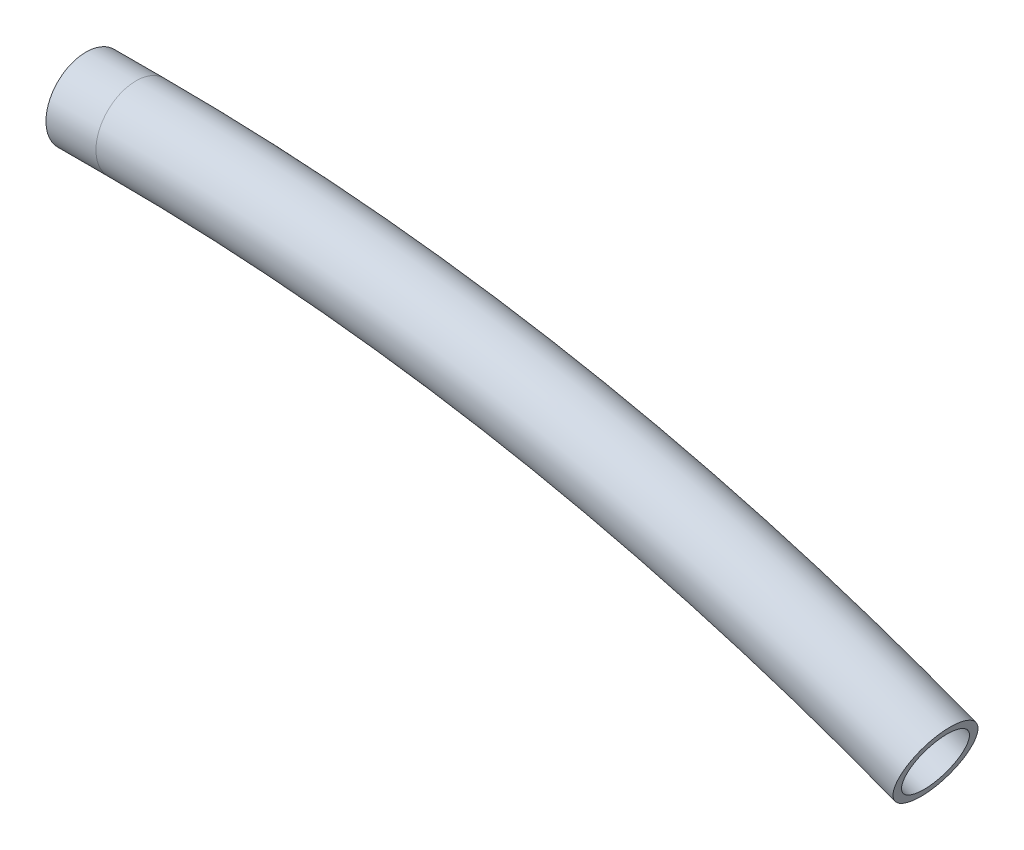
ISO-10303-21;
HEADER;
FILE_DESCRIPTION(('STEP AP214'),'2;1');
FILE_NAME('part.step','',(''),(''),'','','');
FILE_SCHEMA(('AUTOMOTIVE_DESIGN { 1 0 10303 214 1 1 1 1 }'));
ENDSEC;
DATA;
#1=APPLICATION_CONTEXT('core data for automotive mechanical design processes');
#2=APPLICATION_PROTOCOL_DEFINITION('international standard','automotive_design',2000,#1);
#3=PRODUCT_CONTEXT('',#1,'mechanical');
#4=PRODUCT('Part','Part','',(#3));
#5=PRODUCT_RELATED_PRODUCT_CATEGORY('part','',(#4));
#6=PRODUCT_DEFINITION_FORMATION('','',#4);
#7=PRODUCT_DEFINITION_CONTEXT('part definition',#1,'design');
#8=PRODUCT_DEFINITION('design','',#6,#7);
#9=PRODUCT_DEFINITION_SHAPE('','',#8);
#10=(LENGTH_UNIT() NAMED_UNIT(*) SI_UNIT(.MILLI.,.METRE.));
#11=(NAMED_UNIT(*) PLANE_ANGLE_UNIT() SI_UNIT($,.RADIAN.));
#12=(NAMED_UNIT(*) SI_UNIT($,.STERADIAN.) SOLID_ANGLE_UNIT());
#13=UNCERTAINTY_MEASURE_WITH_UNIT(LENGTH_MEASURE(1.E-05),#10,'distance_accuracy_value','');
#14=(GEOMETRIC_REPRESENTATION_CONTEXT(3) GLOBAL_UNCERTAINTY_ASSIGNED_CONTEXT((#13)) GLOBAL_UNIT_ASSIGNED_CONTEXT((#10,
#11,#12)) REPRESENTATION_CONTEXT('',''));
#15=CARTESIAN_POINT('',(0.,0.,0.));
#16=DIRECTION('',(0.,0.,1.));
#17=DIRECTION('',(1.,0.,0.));
#18=AXIS2_PLACEMENT_3D('',#15,#16,#17);
#19=CARTESIAN_POINT('',(10.,-441.666666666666,0.));
#20=DIRECTION('',(0.,0.,-1.));
#21=DIRECTION('',(-1.,0.,0.));
#22=AXIS2_PLACEMENT_3D('',#19,#20,#21);
#23=TOROIDAL_SURFACE('',#22,441.666666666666,8.);
#24=CARTESIAN_POINT('',(9.99999999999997,0.,0.));
#25=DIRECTION('',(1.,0.,0.));
#26=DIRECTION('',(0.,0.,-1.));
#27=AXIS2_PLACEMENT_3D('',#24,#25,#26);
#28=CIRCLE('',#27,8.);
#29=CARTESIAN_POINT('',(9.99999999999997,8.00000000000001,0.));
#30=VERTEX_POINT('',#29);
#31=EDGE_CURVE('E34',#30,#30,#28,.T.);
#32=CARTESIAN_POINT('',(170.,-30.,0.));
#33=DIRECTION('',(0.932075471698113,-0.362264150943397,0.));
#34=DIRECTION('',(0.,0.,-1.));
#35=AXIS2_PLACEMENT_3D('',#32,#33,#34);
#36=CIRCLE('',#35,8.);
#37=CARTESIAN_POINT('',(172.898113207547,-22.5433962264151,0.));
#38=VERTEX_POINT('',#37);
#39=EDGE_CURVE('E10',#38,#38,#36,.T.);
#40=CARTESIAN_POINT('',(10.,-441.666666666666,0.));
#41=DIRECTION('',(0.,0.,-1.));
#42=DIRECTION('',(-1.,0.,0.));
#43=AXIS2_PLACEMENT_3D('',#40,#41,#42);
#44=CIRCLE('',#43,449.666666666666);
#45=EDGE_CURVE('',#30,#38,#44,.T.);
#46=ORIENTED_EDGE('',*,*,#31,.T.);
#47=ORIENTED_EDGE('',*,*,#39,.F.);
#48=ORIENTED_EDGE('',*,*,#45,.T.);
#49=ORIENTED_EDGE('',*,*,#45,.F.);
#50=EDGE_LOOP('',(#46,#48,#47,#49));
#51=FACE_BOUND('',#50,.T.);
#52=ADVANCED_FACE('F24',(#51),#23,.T.);
#53=CARTESIAN_POINT('',(10.,-441.666666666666,0.));
#54=DIRECTION('',(0.,0.,-1.));
#55=DIRECTION('',(-1.,0.,0.));
#56=AXIS2_PLACEMENT_3D('',#53,#54,#55);
#57=TOROIDAL_SURFACE('',#56,441.666666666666,6.4);
#58=CARTESIAN_POINT('',(9.99999999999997,0.,0.));
#59=DIRECTION('',(1.,0.,0.));
#60=DIRECTION('',(0.,0.,-1.));
#61=AXIS2_PLACEMENT_3D('',#58,#59,#60);
#62=CIRCLE('',#61,6.4);
#63=CARTESIAN_POINT('',(9.99999999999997,6.40000000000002,0.));
#64=VERTEX_POINT('',#63);
#65=EDGE_CURVE('E38',#64,#64,#62,.T.);
#66=CARTESIAN_POINT('',(170.,-30.,0.));
#67=DIRECTION('',(0.932075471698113,-0.362264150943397,0.));
#68=DIRECTION('',(0.,0.,-1.));
#69=AXIS2_PLACEMENT_3D('',#66,#67,#68);
#70=CIRCLE('',#69,6.4);
#71=CARTESIAN_POINT('',(172.318490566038,-24.0347169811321,0.));
#72=VERTEX_POINT('',#71);
#73=EDGE_CURVE('E30',#72,#72,#70,.T.);
#74=CARTESIAN_POINT('',(10.,-441.666666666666,0.));
#75=DIRECTION('',(0.,0.,-1.));
#76=DIRECTION('',(-1.,0.,0.));
#77=AXIS2_PLACEMENT_3D('',#74,#75,#76);
#78=CIRCLE('',#77,448.066666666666);
#79=EDGE_CURVE('',#64,#72,#78,.T.);
#80=ORIENTED_EDGE('',*,*,#65,.F.);
#81=ORIENTED_EDGE('',*,*,#73,.T.);
#82=ORIENTED_EDGE('',*,*,#79,.T.);
#83=ORIENTED_EDGE('',*,*,#79,.F.);
#84=EDGE_LOOP('',(#80,#82,#81,#83));
#85=FACE_BOUND('',#84,.T.);
#86=ADVANCED_FACE('F56',(#85),#57,.F.);
#87=CARTESIAN_POINT('',(9.99999999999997,0.,0.));
#88=DIRECTION('',(-1.,0.,0.));
#89=DIRECTION('',(0.,0.,1.));
#90=AXIS2_PLACEMENT_3D('',#87,#88,#89);
#91=CYLINDRICAL_SURFACE('',#90,6.4);
#92=ORIENTED_EDGE('',*,*,#65,.T.);
#93=EDGE_LOOP('',(#92));
#94=FACE_BOUND('',#93,.T.);
#95=CARTESIAN_POINT('',(0.,0.,0.));
#96=DIRECTION('',(1.,0.,0.));
#97=DIRECTION('',(0.,0.,-1.));
#98=AXIS2_PLACEMENT_3D('',#95,#96,#97);
#99=CIRCLE('',#98,6.4);
#100=CARTESIAN_POINT('',(0.,0.,-6.4));
#101=VERTEX_POINT('',#100);
#102=EDGE_CURVE('E46',#101,#101,#99,.T.);
#103=ORIENTED_EDGE('',*,*,#102,.F.);
#104=EDGE_LOOP('',(#103));
#105=FACE_BOUND('',#104,.T.);
#106=ADVANCED_FACE('F53',(#94,#105),#91,.F.);
#107=CARTESIAN_POINT('',(9.99999999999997,0.,0.));
#108=DIRECTION('',(-1.,0.,0.));
#109=DIRECTION('',(0.,0.,1.));
#110=AXIS2_PLACEMENT_3D('',#107,#108,#109);
#111=CYLINDRICAL_SURFACE('',#110,8.);
#112=ORIENTED_EDGE('',*,*,#31,.F.);
#113=EDGE_LOOP('',(#112));
#114=FACE_BOUND('',#113,.T.);
#115=CARTESIAN_POINT('',(0.,0.,0.));
#116=DIRECTION('',(1.,0.,0.));
#117=DIRECTION('',(0.,0.,-1.));
#118=AXIS2_PLACEMENT_3D('',#115,#116,#117);
#119=CIRCLE('',#118,8.);
#120=CARTESIAN_POINT('',(0.,0.,-8.));
#121=VERTEX_POINT('',#120);
#122=EDGE_CURVE('E43',#121,#121,#119,.T.);
#123=ORIENTED_EDGE('',*,*,#122,.T.);
#124=EDGE_LOOP('',(#123));
#125=FACE_BOUND('',#124,.T.);
#126=ADVANCED_FACE('F55',(#114,#125),#111,.T.);
#127=CARTESIAN_POINT('',(170.,-30.,0.));
#128=DIRECTION('',(0.932075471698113,-0.362264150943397,0.));
#129=DIRECTION('',(0.,0.,-1.));
#130=AXIS2_PLACEMENT_3D('',#127,#128,#129);
#131=PLANE('',#130);
#132=ORIENTED_EDGE('',*,*,#73,.F.);
#133=EDGE_LOOP('',(#132));
#134=FACE_BOUND('',#133,.T.);
#135=ORIENTED_EDGE('',*,*,#39,.T.);
#136=EDGE_LOOP('',(#135));
#137=FACE_BOUND('',#136,.T.);
#138=ADVANCED_FACE('F63',(#134,#137),#131,.T.);
#139=CARTESIAN_POINT('',(0.,0.,0.));
#140=DIRECTION('',(1.,0.,0.));
#141=DIRECTION('',(0.,0.,-1.));
#142=AXIS2_PLACEMENT_3D('',#139,#140,#141);
#143=PLANE('',#142);
#144=ORIENTED_EDGE('',*,*,#102,.T.);
#145=EDGE_LOOP('',(#144));
#146=FACE_BOUND('',#145,.T.);
#147=ORIENTED_EDGE('',*,*,#122,.F.);
#148=EDGE_LOOP('',(#147));
#149=FACE_BOUND('',#148,.T.);
#150=ADVANCED_FACE('F50',(#146,#149),#143,.F.);
#151=CLOSED_SHELL('',(#52,#86,#106,#126,#138,#150));
#152=MANIFOLD_SOLID_BREP('B2',#151);
#153=ADVANCED_BREP_SHAPE_REPRESENTATION('',(#18,#152),#14);
#154=SHAPE_DEFINITION_REPRESENTATION(#9,#153);
ENDSEC;
END-ISO-10303-21;
